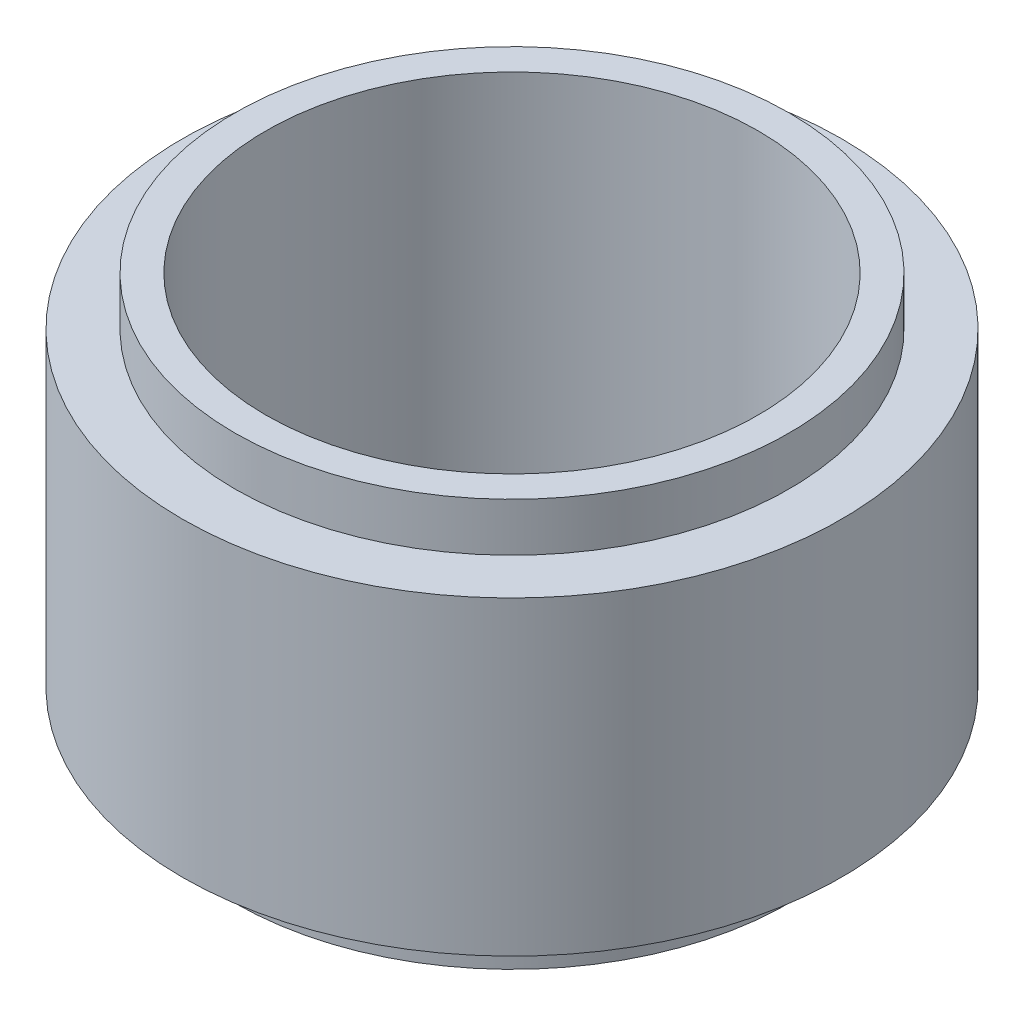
from build123d import *


with BuildPart() as part:
    # Sketch1 → Base-Revolve (revolve)
    with BuildSketch(Plane.XY, mode=Mode.PRIVATE) as base_revolve_sk:
        Polygon((7.15, 5.25), (7.15, 4), (8.5, 4), (8.5, -4), (7.15, -4), (7.15, -5.25), (6.35, -5.25), (6.35, 5.25), align=None)
    revolve(base_revolve_sk.sketch.rotate(Axis((0, 0, 0), (0, 1, 0)), 90), axis=Axis((0, 0, 0), (0, 1, 0)))


solid = part.part
